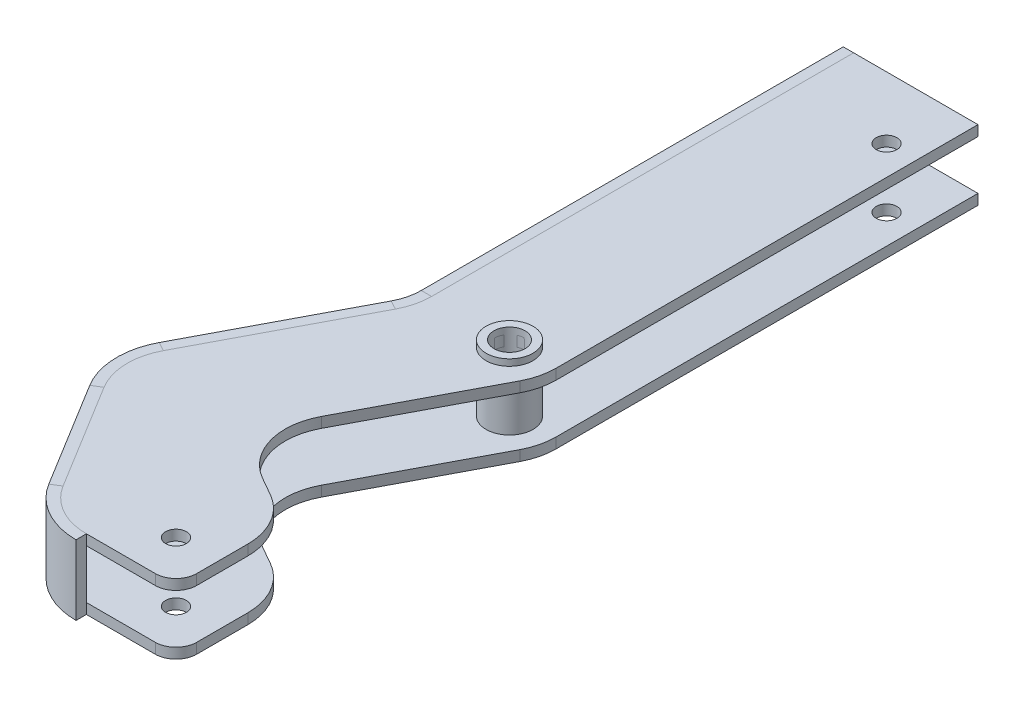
from build123d import *

# Parameters (mm, degrees)
BOSS_EXTRUDE1_DEPTH                  = 10.7061
CUT_EXTRUDE1_DEPTH                   = 143.03341365
CUT_EXTRUDE1_DEPTH_BACK              = 143.03341365
SKETCH9_W                            = 245.108391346
SKETCH9_H                            = 15.0622
SKETCH10_W                           = 3.175
SKETCH10_H                           = 21.4122
CUT_EXTRUDE2_DEPTH                   = 148.353014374
CUT_EXTRUDE2_DEPTH_BACK              = 148.353014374
CUT_EXTRUDE3_DEPTH                   = 144.277091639
CUT_EXTRUDE3_DEPTH_BACK              = 144.277091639
SKETCH12_W                           = 63.5
SKETCH12_H                           = 15.0622
SKETCH4_W                            = 3.175
SKETCH4_H                            = 21.4122
F_1_4_0_25_DIAMETER_SLOT1_AT_2_COUNT = 2
F_1_4_0_25_DIAMETER_SLOT1_AT_2_PITCH = 213.401800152
SKETCH5_R                            = 7.1755
BOSS_EXTRUDE2_DEPTH                  = 12.7
SKETCH7_W                            = 4.7625
SKETCH7_H                            = 25.4
CUT_EXTRUDE4_DEPTH                   = 145.781041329
CUT_EXTRUDE4_DEPTH_BACK              = 145.781041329


with BuildPart() as part:
    # Sketch1 → Boss-Extrude1 (new, symmetric)
    with BuildSketch(Plane(origin=(0, 0, 0), x_dir=(1, 0, 0), z_dir=(0, 1, 0))):
        with BuildLine():
            Line((-25.4, 130.81), (-25.4, 1.532084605))
            ThreePointArc((-25.4, 1.532084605), (-25.956196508, -3.037568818), (-27.592307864, -7.340384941))
            Line((-27.592307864, -7.340384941), (-52.099624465, -53.904286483))
            ThreePointArc((-52.099624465, -53.904286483), (-54.281560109, -63.405305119), (-51.477749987, -72.741730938))
            Line((-51.477749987, -72.741730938), (-31.547800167, -105.213366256))
            ThreePointArc((-31.547800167, -105.213366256), (-24.614394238, -111.872699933), (-15.311982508, -114.298391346))
            Line((-15.311982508, -114.298391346), (5.778269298, -114.298391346))
            ThreePointArc((5.778269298, -114.298391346), (10.268397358, -112.438519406), (12.128269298, -107.948391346))
            Line((12.128269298, -107.948391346), (12.128269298, -92.31391113))
            ThreePointArc((12.128269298, -92.31391113), (9.545195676, -82.735663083), (2.496475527, -75.754928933))
            Line((2.496475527, -75.754928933), (-3.023185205, -72.615526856))
            ThreePointArc((-3.023185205, -72.615526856), (-11.88872567, -61.405105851), (-10.462671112, -47.184075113))
            Line((-10.462671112, -47.184075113), (10.507692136, -7.340384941))
            ThreePointArc((10.507692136, -7.340384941), (12.143803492, -3.037568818), (12.7, 1.532084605))
            Line((12.7, 1.532084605), (12.7, 130.81))
            Line((12.7, 130.81), (-25.4, 130.81))
        make_face()
    extrude(amount=BOSS_EXTRUDE1_DEPTH, both=True)

    # Sketch9 → Cut-Extrude1 (cut, two sides: drawn at the far end of the back side and taken through both)
    with BuildSketch(Plane(origin=(0, 0, 0), x_dir=(0, 0, -1), z_dir=(1, 0, 0)).offset(-CUT_EXTRUDE1_DEPTH_BACK)):
        with Locations((8.255804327, 0)):
            Rectangle(SKETCH9_W, SKETCH9_H)
    extrude(amount=CUT_EXTRUDE1_DEPTH + CUT_EXTRUDE1_DEPTH_BACK, mode=Mode.SUBTRACT)


with BuildPart() as cut_extrude1_piece_1:
    # of the separate pieces the step leaves, piece 1, a body of its own (cut_extrude1_pieces)
    add(part.part.solids().sort_by_distance((10.507692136, -7.5311, 7.340384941))[0])


with BuildPart() as cut_extrude1_piece_2:
    # of the separate pieces the step leaves, piece 2, a body of its own (cut_extrude1_pieces)
    add(part.part.solids().sort_by_distance((10.507692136, 10.7061, 7.340384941))[0])


with BuildPart() as body_3:
    # Sweep1: sweep along a path in Sketch1_3
    with BuildLine(Plane(origin=(0, 0, 0), x_dir=(1, 0, 0), z_dir=(0, 1, 0))) as sweep1_path:
        Line((-25.4, 130.81), (-25.4, 1.532084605))
        ThreePointArc((-25.4, 1.532084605), (-25.956196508, -3.037568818), (-27.592307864, -7.340384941))
        Line((-27.592307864, -7.340384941), (-52.099624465, -53.904286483))
        ThreePointArc((-52.099624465, -53.904286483), (-54.281560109, -63.405305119), (-51.477749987, -72.741730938))
        Line((-51.477749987, -72.741730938), (-31.547800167, -105.213366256))
        ThreePointArc((-31.547800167, -105.213366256), (-24.614394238, -111.872699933), (-15.311982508, -114.298391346))
        Line((-15.311982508, -114.298391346), (5.778269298, -114.298391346))
        ThreePointArc((5.778269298, -114.298391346), (10.268397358, -112.438519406), (12.128269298, -107.948391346))
        Line((12.128269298, -107.948391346), (12.128269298, -92.31391113))
        ThreePointArc((12.128269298, -92.31391113), (9.545195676, -82.735663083), (2.496475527, -75.754928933))
        Line((2.496475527, -75.754928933), (-3.023185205, -72.615526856))
        ThreePointArc((-3.023185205, -72.615526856), (-11.88872567, -61.405105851), (-10.462671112, -47.184075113))
        Line((-10.462671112, -47.184075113), (10.507692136, -7.340384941))
        ThreePointArc((10.507692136, -7.340384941), (12.143803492, -3.037568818), (12.7, 1.532084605))
        Line((12.7, 1.532084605), (12.7, 130.81))
        Line((12.7, 130.81), (-25.4, 130.81))
    # Sketch10 → Sweep1 (sweep)
    with BuildSketch(Plane(origin=(-25.4, 0, -130.81), x_dir=(1, 0, 0), z_dir=(0, 0, 1))):
        with Locations((-1.5875, 0)):
            Rectangle(SKETCH10_W, SKETCH10_H)
    sweep(path=sweep1_path.line, transition=Transition.RIGHT)

    # Sketch11 → Cut-Extrude2 (cut, two sides: drawn at the far end of the back side and taken through both)
    with BuildSketch(Plane.XZ.offset(10.7061).offset(-CUT_EXTRUDE2_DEPTH_BACK)):
        Polygon((12.7, -130.81), (-28.575, -130.81), (-28.575, -133.985), (15.875, -133.985), (15.875, -1.532084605), (12.7, -1.532084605), align=None)
    extrude(amount=CUT_EXTRUDE2_DEPTH + CUT_EXTRUDE2_DEPTH_BACK, mode=Mode.SUBTRACT)

    # Sketch12 → Cut-Extrude3 (cut, two sides: drawn at the far end of the back side and taken through both)
    with BuildSketch(Plane.XY.offset(-CUT_EXTRUDE3_DEPTH_BACK)):
        with Locations((19.05, 0)):
            Rectangle(SKETCH12_W, SKETCH12_H)
    extrude(amount=CUT_EXTRUDE3_DEPTH + CUT_EXTRUDE3_DEPTH_BACK, mode=Mode.SUBTRACT)

    # Sketch15 → Cut-Extrude4 (cut, two sides: drawn at the far end of the back side and taken through both)
    with BuildSketch(Plane(origin=(0, 10.7061, 0), x_dir=(1, 0, 0), z_dir=(0, 1, 0)).offset(-CUT_EXTRUDE4_DEPTH_BACK)):
        with BuildLine():
            Line((12.7, 1.532084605), (15.875, 1.532084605))
            ThreePointArc((15.875, 1.532084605), (15.226104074, -3.799177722), (13.317307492, -8.819129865))
            Line((13.317307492, -8.819129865), (-7.653055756, -48.662820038))
            ThreePointArc((-7.653055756, -48.662820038), (-8.841434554, -60.513678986), (-1.453484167, -69.85569649))
            Line((-1.453484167, -69.85569649), (4.066176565, -72.995098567))
            ThreePointArc((4.066176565, -72.995098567), (12.289683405, -81.139288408), (15.303269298, -92.31391113))
            Line((15.303269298, -92.31391113), (15.303269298, -107.948391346))
            ThreePointArc((15.303269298, -107.948391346), (12.513461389, -114.683583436), (5.778269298, -117.473391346))
            Line((5.778269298, -117.473391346), (-15.311982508, -117.473391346))
            Line((-15.311982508, -117.473391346), (-15.311982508, -114.298391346))
            Line((-15.311982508, -114.298391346), (5.778269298, -114.298391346))
            ThreePointArc((5.778269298, -114.298391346), (10.268397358, -112.438519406), (12.128269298, -107.948391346))
            Line((12.128269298, -107.948391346), (12.128269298, -92.31391113))
            ThreePointArc((12.128269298, -92.31391113), (9.545195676, -82.735663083), (2.496475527, -75.754928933))
            Line((2.496475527, -75.754928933), (-3.023185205, -72.615526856))
            ThreePointArc((-3.023185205, -72.615526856), (-11.88872567, -61.405105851), (-10.462671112, -47.184075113))
            Line((-10.462671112, -47.184075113), (10.507692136, -7.340384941))
            ThreePointArc((10.507692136, -7.340384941), (12.143803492, -3.037568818), (12.7, 1.532084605))
        make_face()
    extrude(amount=CUT_EXTRUDE4_DEPTH + CUT_EXTRUDE4_DEPTH_BACK, mode=Mode.SUBTRACT)


with BuildPart() as f_1_4_0_25_diameter_slot1_tool:
    # Sketch4 → 1_4 _0.25_ Diameter Slot1 (revolve)
    with BuildSketch(Plane(origin=(3.732354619, 10.7061, -111.76), x_dir=(0, 0, 1), z_dir=(1, 0, 0))):
        with Locations((1.5875, 10.7061)):
            Rectangle(SKETCH4_W, SKETCH4_H)
    f_1_4_0_25_diameter_slot1 = revolve(axis=Axis((3.732354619, 17.0561, -111.76), (0, -1, 0)))


with BuildPart() as cut_extrude1_piece_1_1:
    add(cut_extrude1_piece_1.part)

    # 1_4 _0.25_ Diameter Slot1: cut by f_1_4_0_25_diameter_slot1_tool
    add(f_1_4_0_25_diameter_slot1_tool.part, mode=Mode.SUBTRACT)


with BuildPart() as cut_extrude1_piece_2_1:
    add(cut_extrude1_piece_2.part)

    # 1_4 _0.25_ Diameter Slot1: cut by f_1_4_0_25_diameter_slot1_tool
    add(f_1_4_0_25_diameter_slot1_tool.part, mode=Mode.SUBTRACT)


with BuildPart() as f_1_4_0_25_diameter_slot1_at_2_tool:
    # 1_4 _0.25_ Diameter Slot1 at 2: 1_4 _0.25_ Diameter Slot1 ×2
    with Locations(*[Vector(-0.020168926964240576, 0, 0.9997965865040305) * (i * F_1_4_0_25_DIAMETER_SLOT1_AT_2_PITCH) for i in range(1, F_1_4_0_25_DIAMETER_SLOT1_AT_2_COUNT)]):
        add(f_1_4_0_25_diameter_slot1)


with BuildPart() as cut_extrude1_piece_1_2:
    add(cut_extrude1_piece_1_1.part)

    # 1_4 _0.25_ Diameter Slot1 at 2: cut by f_1_4_0_25_diameter_slot1_at_2_tool
    add(f_1_4_0_25_diameter_slot1_at_2_tool.part, mode=Mode.SUBTRACT)

    # Sketch5 → Boss-Extrude2 (add, symmetric)
    with BuildSketch(Plane(origin=(0, 0, 0), x_dir=(1, 0, 0), z_dir=(0, 1, 0))):
        with Locations(Location((0, 0, 0), (0, 0, 90))):
            Circle(SKETCH5_R)
    extrude(amount=BOSS_EXTRUDE2_DEPTH, both=True)


with BuildPart() as cut_extrude1_piece_2_2:
    add(cut_extrude1_piece_2_1.part)

    # 1_4 _0.25_ Diameter Slot1 at 2: cut by f_1_4_0_25_diameter_slot1_at_2_tool
    add(f_1_4_0_25_diameter_slot1_at_2_tool.part, mode=Mode.SUBTRACT)


with BuildPart() as f_3_8_0_375_diameter_slot1_tool:
    # Sketch7 → 3_8 _0.375_ Diameter Slot1 (revolve)
    with BuildSketch(Plane(origin=(0, 12.7, 0), x_dir=(0, 0, 1), z_dir=(1, 0, 0))):
        with Locations((2.38125, 12.7)):
            Rectangle(SKETCH7_W, SKETCH7_H)
    revolve(axis=Axis((0, 19.05, 0), (0, -1, 0)))


with BuildPart() as cut_extrude1_piece_1_3:
    add(cut_extrude1_piece_1_2.part)

    # 3_8 _0.375_ Diameter Slot1: cut by f_3_8_0_375_diameter_slot1_tool
    add(f_3_8_0_375_diameter_slot1_tool.part, mode=Mode.SUBTRACT)


with BuildPart() as cut_extrude1_piece_2_3:
    add(cut_extrude1_piece_2_2.part)

    # 3_8 _0.375_ Diameter Slot1: cut by f_3_8_0_375_diameter_slot1_tool
    add(f_3_8_0_375_diameter_slot1_tool.part, mode=Mode.SUBTRACT)


solid = Compound([body_3.part, cut_extrude1_piece_1_3.part, cut_extrude1_piece_2_3.part])
